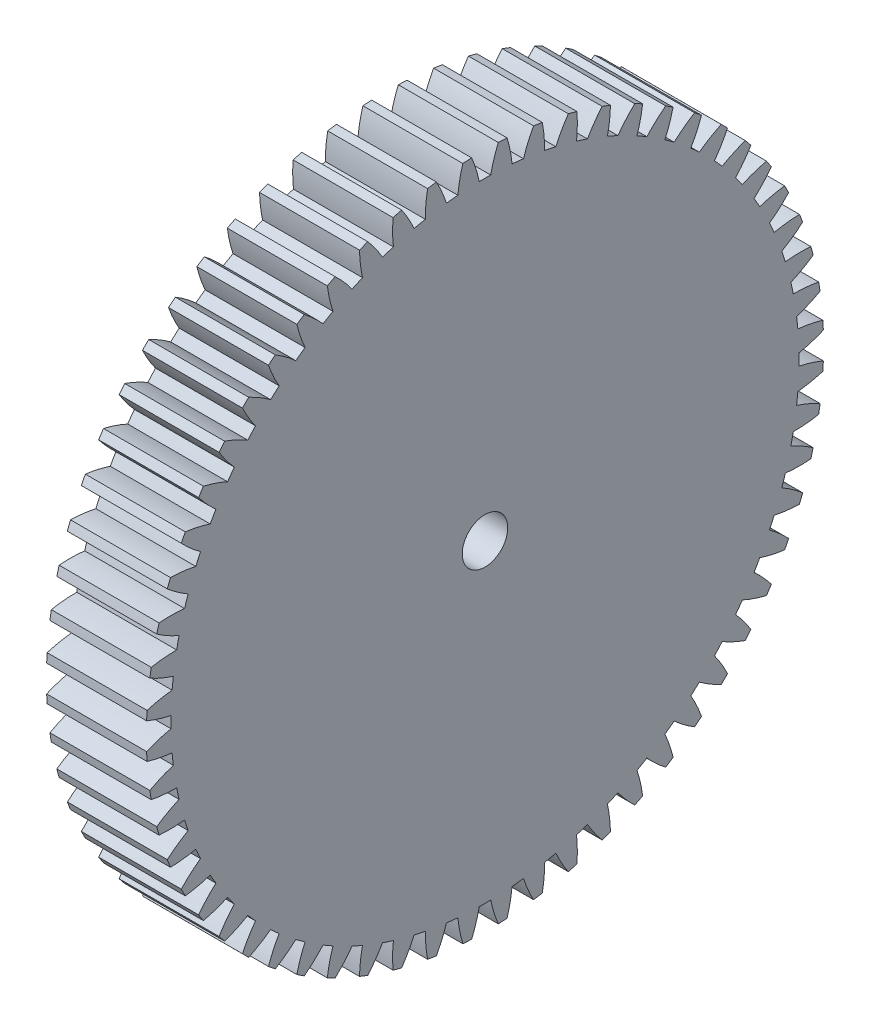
from build123d import *

# Parameters (mm, degrees)
BASPROSKE_W        = 5.49
BASPROSKE_H        = 18.6
TOOTHCUT_DEPTH     = 27.871176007
TEETHCUTS_COUNT    = 60
TEETHCUTS_ANGLE    = 354
BORSKE_R           = 0.4
BORE_DEPTH         = 50.0000508
SKETCH1_R          = 1.25
CUT_EXTRUDE1_DEPTH = 27.851291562


with BuildPart() as part:
    # BasProSke → Base-Revolve (revolve)
    with BuildSketch(Plane(origin=(0, 0, 0), x_dir=(1, 0, 0), z_dir=(0, 1, 0)), mode=Mode.PRIVATE) as base_revolve_sk:
        with Locations((2.745, 9.3)):
            Rectangle(BASPROSKE_W, BASPROSKE_H)
    revolve(base_revolve_sk.sketch.rotate(Axis((-10, 0, 0), (1, 0, 0)), 180), axis=Axis((-10, 0, 0), (1, 0, 0)))

    # TooCutSke → ToothCut (cut, through all)
    with BuildSketch(Plane(origin=(0, 0, 0), x_dir=(0, 0, -1), z_dir=(1, 0, 0))):
        with BuildLine():
            ThreePointArc((0.315314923, 17.246117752), (0, 17.249), (-0.315314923, 17.246117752))
            ThreePointArc((-0.315314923, 17.246117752), (-0.494415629, 17.938978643), (-0.741412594, 18.610637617))
            ThreePointArc((-0.741412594, 18.610637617), (0, 18.6254), (0.741412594, 18.610637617))
            ThreePointArc((0.741412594, 18.610637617), (0.494415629, 17.938978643), (0.315314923, 17.246117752))
        make_face()
    toothcut = extrude(amount=TOOTHCUT_DEPTH, mode=Mode.SUBTRACT)

    # TeethCuts: ToothCut ×60 about axis
    teethcuts_axis = Axis((-10, 0, 0), (1, 0, 0))
    for i in range(1, TEETHCUTS_COUNT):
        add(toothcut.rotate(teethcuts_axis, i * TEETHCUTS_ANGLE / (TEETHCUTS_COUNT - 1)), mode=Mode.SUBTRACT)

    # BorSke → Bore (cut, symmetric)
    with BuildSketch(Plane(origin=(0, 0, 0), x_dir=(0, 0, -1), z_dir=(1, 0, 0))):
        with Locations(Location((0, 0, 0), (0, 0, 180))):
            Circle(BORSKE_R)
    extrude(amount=BORE_DEPTH, both=True, mode=Mode.SUBTRACT)

    # Sketch1 → Cut-Extrude1 (cut, through all)
    with BuildSketch(Plane(origin=(5.49, 0, 0), x_dir=(0, 0, -1), z_dir=(1, 0, 0))):
        Circle(SKETCH1_R)
    extrude(amount=-CUT_EXTRUDE1_DEPTH, mode=Mode.SUBTRACT)


solid = part.part
